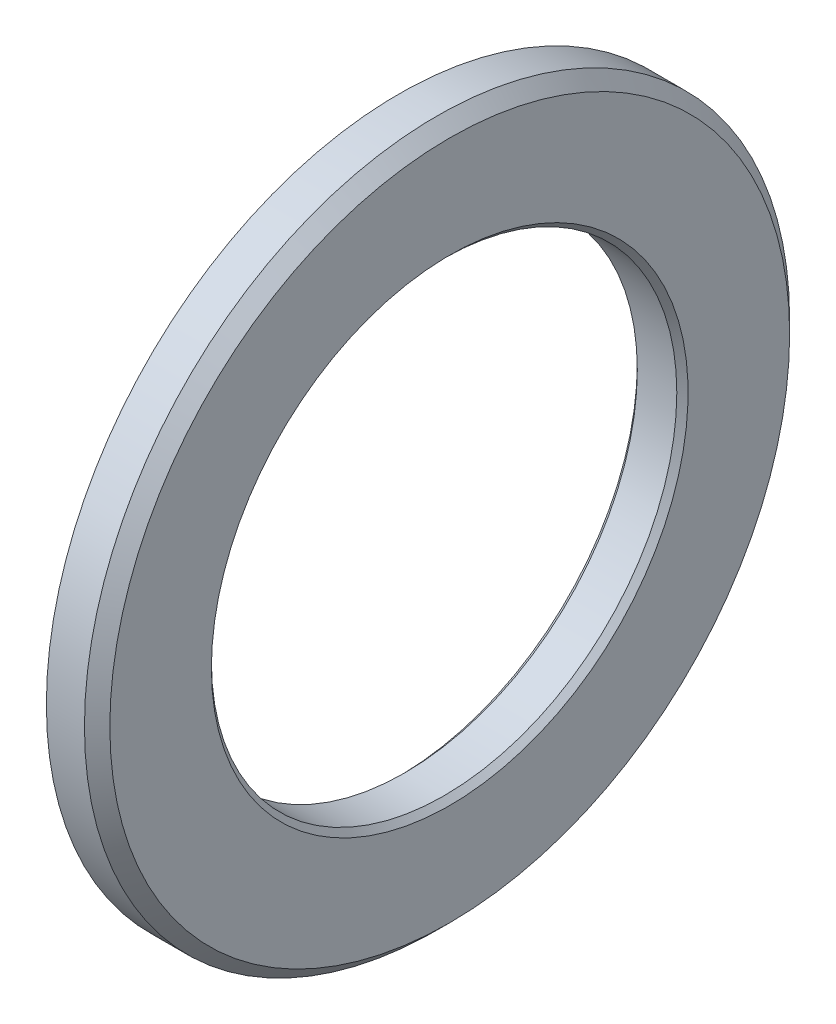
ISO-10303-21;
HEADER;
FILE_DESCRIPTION(('STEP AP214'),'2;1');
FILE_NAME('part.step','',(''),(''),'','','');
FILE_SCHEMA(('AUTOMOTIVE_DESIGN { 1 0 10303 214 1 1 1 1 }'));
ENDSEC;
DATA;
#1=APPLICATION_CONTEXT('core data for automotive mechanical design processes');
#2=APPLICATION_PROTOCOL_DEFINITION('international standard','automotive_design',2000,#1);
#3=PRODUCT_CONTEXT('',#1,'mechanical');
#4=PRODUCT('Part','Part','',(#3));
#5=PRODUCT_RELATED_PRODUCT_CATEGORY('part','',(#4));
#6=PRODUCT_DEFINITION_FORMATION('','',#4);
#7=PRODUCT_DEFINITION_CONTEXT('part definition',#1,'design');
#8=PRODUCT_DEFINITION('design','',#6,#7);
#9=PRODUCT_DEFINITION_SHAPE('','',#8);
#10=(LENGTH_UNIT() NAMED_UNIT(*) SI_UNIT(.MILLI.,.METRE.));
#11=(NAMED_UNIT(*) PLANE_ANGLE_UNIT() SI_UNIT($,.RADIAN.));
#12=(NAMED_UNIT(*) SI_UNIT($,.STERADIAN.) SOLID_ANGLE_UNIT());
#13=UNCERTAINTY_MEASURE_WITH_UNIT(LENGTH_MEASURE(1.E-05),#10,'distance_accuracy_value','');
#14=(GEOMETRIC_REPRESENTATION_CONTEXT(3) GLOBAL_UNCERTAINTY_ASSIGNED_CONTEXT((#13)) GLOBAL_UNIT_ASSIGNED_CONTEXT((#10,
#11,#12)) REPRESENTATION_CONTEXT('',''));
#15=CARTESIAN_POINT('',(0.,0.,0.));
#16=DIRECTION('',(0.,0.,1.));
#17=DIRECTION('',(1.,0.,0.));
#18=AXIS2_PLACEMENT_3D('',#15,#16,#17);
#19=CARTESIAN_POINT('',(-34.9249999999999,0.,0.));
#20=DIRECTION('',(-1.,0.,0.));
#21=DIRECTION('',(0.,0.,1.));
#22=AXIS2_PLACEMENT_3D('',#19,#20,#21);
#23=CYLINDRICAL_SURFACE('',#22,82.5);
#24=CARTESIAN_POINT('',(-16.,0.,0.));
#25=DIRECTION('',(1.,0.,0.));
#26=DIRECTION('',(0.,0.,-1.));
#27=AXIS2_PLACEMENT_3D('',#24,#25,#26);
#28=CIRCLE('',#27,82.5);
#29=CARTESIAN_POINT('',(-16.,0.,-82.5));
#30=VERTEX_POINT('',#29);
#31=EDGE_CURVE('E42',#30,#30,#28,.F.);
#32=ORIENTED_EDGE('',*,*,#31,.T.);
#33=EDGE_LOOP('',(#32));
#34=FACE_BOUND('',#33,.T.);
#35=CARTESIAN_POINT('',(-2.00000000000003,0.,0.));
#36=DIRECTION('',(-1.,0.,0.));
#37=DIRECTION('',(0.,0.,1.));
#38=AXIS2_PLACEMENT_3D('',#35,#36,#37);
#39=CIRCLE('',#38,82.5);
#40=CARTESIAN_POINT('',(-2.00000000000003,0.,82.5));
#41=VERTEX_POINT('',#40);
#42=EDGE_CURVE('E60',#41,#41,#39,.F.);
#43=ORIENTED_EDGE('',*,*,#42,.T.);
#44=EDGE_LOOP('',(#43));
#45=FACE_BOUND('',#44,.T.);
#46=ADVANCED_FACE('F40',(#34,#45),#23,.F.);
#47=CARTESIAN_POINT('',(0.,82.5,0.));
#48=DIRECTION('',(-1.,0.,0.));
#49=DIRECTION('',(0.,0.,1.));
#50=AXIS2_PLACEMENT_3D('',#47,#48,#49);
#51=PLANE('',#50);
#52=CARTESIAN_POINT('',(0.,0.,0.));
#53=DIRECTION('',(-1.,0.,0.));
#54=DIRECTION('',(0.,0.,1.));
#55=AXIS2_PLACEMENT_3D('',#52,#53,#54);
#56=CIRCLE('',#55,120.5);
#57=CARTESIAN_POINT('',(0.,0.,120.5));
#58=VERTEX_POINT('',#57);
#59=EDGE_CURVE('E48',#58,#58,#56,.F.);
#60=ORIENTED_EDGE('',*,*,#59,.T.);
#61=EDGE_LOOP('',(#60));
#62=FACE_BOUND('',#61,.T.);
#63=CARTESIAN_POINT('',(0.,0.,0.));
#64=DIRECTION('',(-1.,0.,0.));
#65=DIRECTION('',(0.,0.,1.));
#66=AXIS2_PLACEMENT_3D('',#63,#64,#65);
#67=CIRCLE('',#66,84.5);
#68=CARTESIAN_POINT('',(0.,0.,84.5));
#69=VERTEX_POINT('',#68);
#70=EDGE_CURVE('E58',#69,#69,#67,.T.);
#71=ORIENTED_EDGE('',*,*,#70,.T.);
#72=EDGE_LOOP('',(#71));
#73=FACE_BOUND('',#72,.T.);
#74=ADVANCED_FACE('F73',(#62,#73),#51,.F.);
#75=CARTESIAN_POINT('',(-34.9249999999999,0.,0.));
#76=DIRECTION('',(-1.,0.,0.));
#77=DIRECTION('',(0.,0.,1.));
#78=AXIS2_PLACEMENT_3D('',#75,#76,#77);
#79=CYLINDRICAL_SURFACE('',#78,125.);
#80=CARTESIAN_POINT('',(-4.49999999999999,0.,0.));
#81=DIRECTION('',(-1.,0.,0.));
#82=DIRECTION('',(0.,0.,1.));
#83=AXIS2_PLACEMENT_3D('',#80,#81,#82);
#84=CIRCLE('',#83,125.);
#85=CARTESIAN_POINT('',(-4.49999999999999,0.,125.));
#86=VERTEX_POINT('',#85);
#87=EDGE_CURVE('E55',#86,#86,#84,.T.);
#88=ORIENTED_EDGE('',*,*,#87,.T.);
#89=EDGE_LOOP('',(#88));
#90=FACE_BOUND('',#89,.T.);
#91=CARTESIAN_POINT('',(-18.,0.,0.));
#92=DIRECTION('',(-1.,0.,0.));
#93=DIRECTION('',(0.,0.,1.));
#94=AXIS2_PLACEMENT_3D('',#91,#92,#93);
#95=CIRCLE('',#94,125.);
#96=CARTESIAN_POINT('',(-18.,0.,125.));
#97=VERTEX_POINT('',#96);
#98=EDGE_CURVE('E62',#97,#97,#95,.T.);
#99=ORIENTED_EDGE('',*,*,#98,.F.);
#100=EDGE_LOOP('',(#99));
#101=FACE_BOUND('',#100,.T.);
#102=ADVANCED_FACE('F68',(#90,#101),#79,.T.);
#103=CARTESIAN_POINT('',(-18.,125.,0.));
#104=DIRECTION('',(1.,0.,0.));
#105=DIRECTION('',(0.,0.,-1.));
#106=AXIS2_PLACEMENT_3D('',#103,#104,#105);
#107=PLANE('',#106);
#108=CARTESIAN_POINT('',(-18.,0.,0.));
#109=DIRECTION('',(1.,0.,0.));
#110=DIRECTION('',(0.,0.,-1.));
#111=AXIS2_PLACEMENT_3D('',#108,#109,#110);
#112=CIRCLE('',#111,84.5);
#113=CARTESIAN_POINT('',(-18.,0.,-84.5));
#114=VERTEX_POINT('',#113);
#115=EDGE_CURVE('E10',#114,#114,#112,.T.);
#116=ORIENTED_EDGE('',*,*,#115,.T.);
#117=EDGE_LOOP('',(#116));
#118=FACE_BOUND('',#117,.T.);
#119=ORIENTED_EDGE('',*,*,#98,.T.);
#120=EDGE_LOOP('',(#119));
#121=FACE_BOUND('',#120,.T.);
#122=ADVANCED_FACE('F66',(#118,#121),#107,.F.);
#123=CARTESIAN_POINT('',(0.,0.,0.));
#124=DIRECTION('',(1.,0.,0.));
#125=DIRECTION('',(0.,0.,-1.));
#126=AXIS2_PLACEMENT_3D('',#123,#124,#125);
#127=CONICAL_SURFACE('',#126,84.5,0.785398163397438);
#128=ORIENTED_EDGE('',*,*,#42,.F.);
#129=EDGE_LOOP('',(#128));
#130=FACE_BOUND('',#129,.T.);
#131=ORIENTED_EDGE('',*,*,#70,.F.);
#132=EDGE_LOOP('',(#131));
#133=FACE_BOUND('',#132,.T.);
#134=ADVANCED_FACE('F79',(#130,#133),#127,.F.);
#135=CARTESIAN_POINT('',(-4.49999999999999,0.,0.));
#136=DIRECTION('',(-1.,0.,0.));
#137=DIRECTION('',(0.,0.,1.));
#138=AXIS2_PLACEMENT_3D('',#135,#136,#137);
#139=CONICAL_SURFACE('',#138,125.,0.78539816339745);
#140=ORIENTED_EDGE('',*,*,#59,.F.);
#141=EDGE_LOOP('',(#140));
#142=FACE_BOUND('',#141,.T.);
#143=ORIENTED_EDGE('',*,*,#87,.F.);
#144=EDGE_LOOP('',(#143));
#145=FACE_BOUND('',#144,.T.);
#146=ADVANCED_FACE('F87',(#142,#145),#139,.T.);
#147=CARTESIAN_POINT('',(-16.,0.,0.));
#148=DIRECTION('',(-1.,0.,0.));
#149=DIRECTION('',(0.,0.,1.));
#150=AXIS2_PLACEMENT_3D('',#147,#148,#149);
#151=CONICAL_SURFACE('',#150,82.5,0.78539816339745);
#152=ORIENTED_EDGE('',*,*,#115,.F.);
#153=EDGE_LOOP('',(#152));
#154=FACE_BOUND('',#153,.T.);
#155=ORIENTED_EDGE('',*,*,#31,.F.);
#156=EDGE_LOOP('',(#155));
#157=FACE_BOUND('',#156,.T.);
#158=ADVANCED_FACE('F39',(#154,#157),#151,.F.);
#159=CLOSED_SHELL('',(#46,#74,#102,#122,#134,#146,#158));
#160=MANIFOLD_SOLID_BREP('B2',#159);
#161=ADVANCED_BREP_SHAPE_REPRESENTATION('',(#18,#160),#14);
#162=SHAPE_DEFINITION_REPRESENTATION(#9,#161);
ENDSEC;
END-ISO-10303-21;
